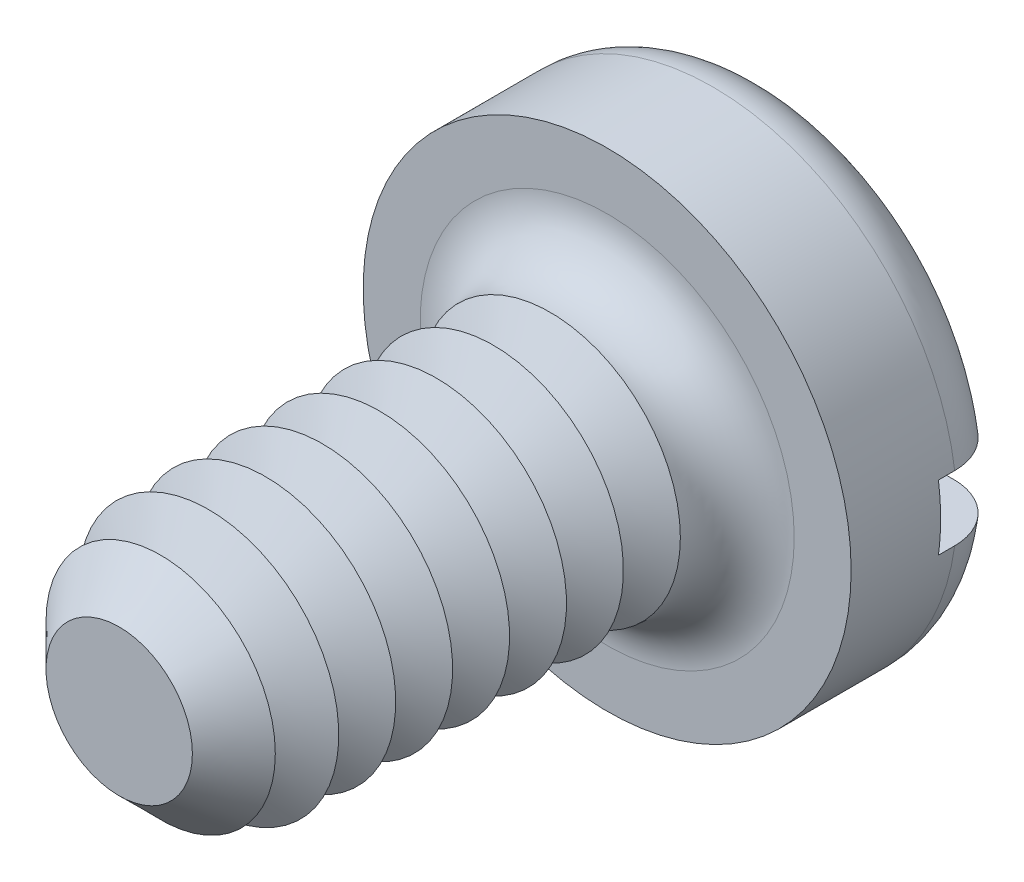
from build123d import *

# Parameters (mm, degrees)
SKETCH3_R           = 1.5
BOSS_EXTRUDE2_DEPTH = 1
SKETCH4_R           = 0.8
BOSS_EXTRUDE3_DEPTH = 3
FILLET1_R           = 0.35
CHAMFER1_SIZE       = 0.35
LPATTERN1_COUNT     = 7
LPATTERN1_PITCH     = 0.35
SKETCH8_W           = 3
SKETCH8_H           = 0.4
CUT_EXTRUDE1_DEPTH  = 0.45


with BuildPart() as part:
    # Sketch3 → Boss-Extrude2 (new body)
    with BuildSketch(Plane.XY):
        Circle(SKETCH3_R)
    extrude(amount=-BOSS_EXTRUDE2_DEPTH)

    # Sketch4 → Boss-Extrude3 (add)
    with BuildSketch(Plane.XY):
        Circle(SKETCH4_R)
    extrude(amount=BOSS_EXTRUDE3_DEPTH)

    # Fillet1
    fillet1_edges = [part.edges().sort_by_distance(p)[0] for p in [
        (-1.5, 0, -1),
        (-0.8, 0, 0),
    ]]
    fillet(fillet1_edges, radius=FILLET1_R)

    # Chamfer1
    chamfer1_edges = [part.edges().sort_by_distance(p)[0] for p in [
        (-0.8, 0, 3),
    ]]
    chamfer(chamfer1_edges, length=CHAMFER1_SIZE)

    # Sketch6 → Cut-Revolve1 (revolve, cut)
    with BuildSketch(Plane(origin=(0, 0, 0), x_dir=(0, 0, -1), z_dir=(1, 0, 0)), mode=Mode.PRIVATE) as cut_revolve1_sk:
        Polygon((-0.35, 0.8), (-0.525, 0.496891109), (-0.7, 0.8), align=None)
    cut_revolve1 = revolve(cut_revolve1_sk.sketch.rotate(Axis((0, 0, -1.694361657), (0, 0, 1)), 90), axis=Axis((0, 0, -1.694361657), (0, 0, 1)), mode=Mode.SUBTRACT)

    # LPattern1: Cut-Revolve1 ×7
    with Locations(*[(0, 0, i * LPATTERN1_PITCH) for i in range(1, LPATTERN1_COUNT)]):
        add(cut_revolve1, mode=Mode.SUBTRACT)

    # Sketch8 → Cut-Extrude1 (cut)
    with BuildSketch(Plane(origin=(0, 0, -1), x_dir=(-1, 0, 0), z_dir=(0, 0, -1))):
        Rectangle(SKETCH8_W, SKETCH8_H)
    extrude(amount=-CUT_EXTRUDE1_DEPTH, mode=Mode.SUBTRACT)


solid = part.part
